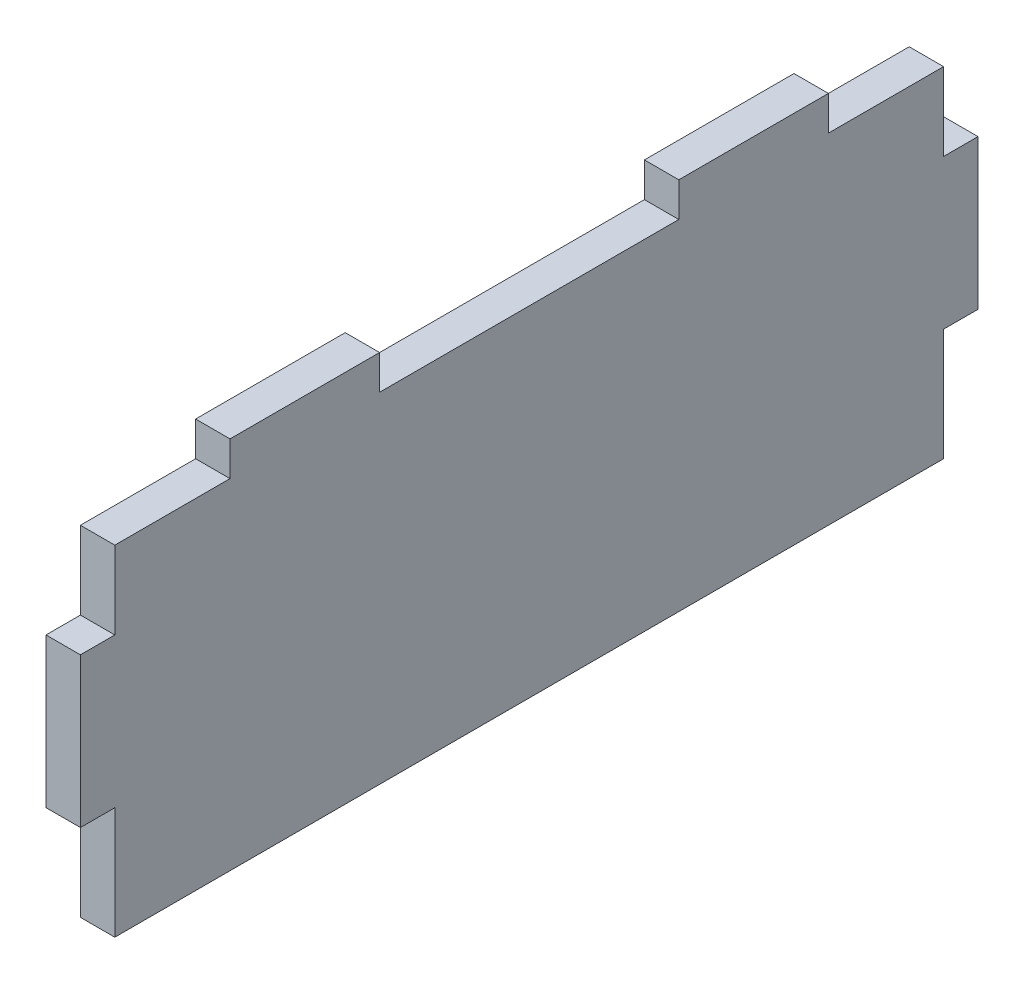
from build123d import *

# Parameters (mm, degrees)
BOSS_EXTRUDE1_DEPTH = 5.842


with BuildPart() as part:
    # Sketch1 → Boss-Extrude1 (new body)
    with BuildSketch(Plane(origin=(0, 0, 0), x_dir=(0, 0, -1), z_dir=(1, 0, 0))):
        Polygon((5.842, -4.226236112), (5.842, 14.823763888), (0, 14.823763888), (0, 40.223763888), (5.842, 40.223763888), (5.842, 53.431763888), (25.4, 53.431763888), (25.4, 59.273763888), (50.8, 59.273763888), (50.8, 53.431763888), (101.6, 53.431763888), (101.6, 59.273763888), (127, 59.273763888), (127, 53.431763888), (146.558, 53.431763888), (146.558, 40.223763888), (152.4, 40.223763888), (152.4, 14.823763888), (146.558, 14.823763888), (146.558, -4.226236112), align=None)
    extrude(amount=BOSS_EXTRUDE1_DEPTH)


solid = part.part
